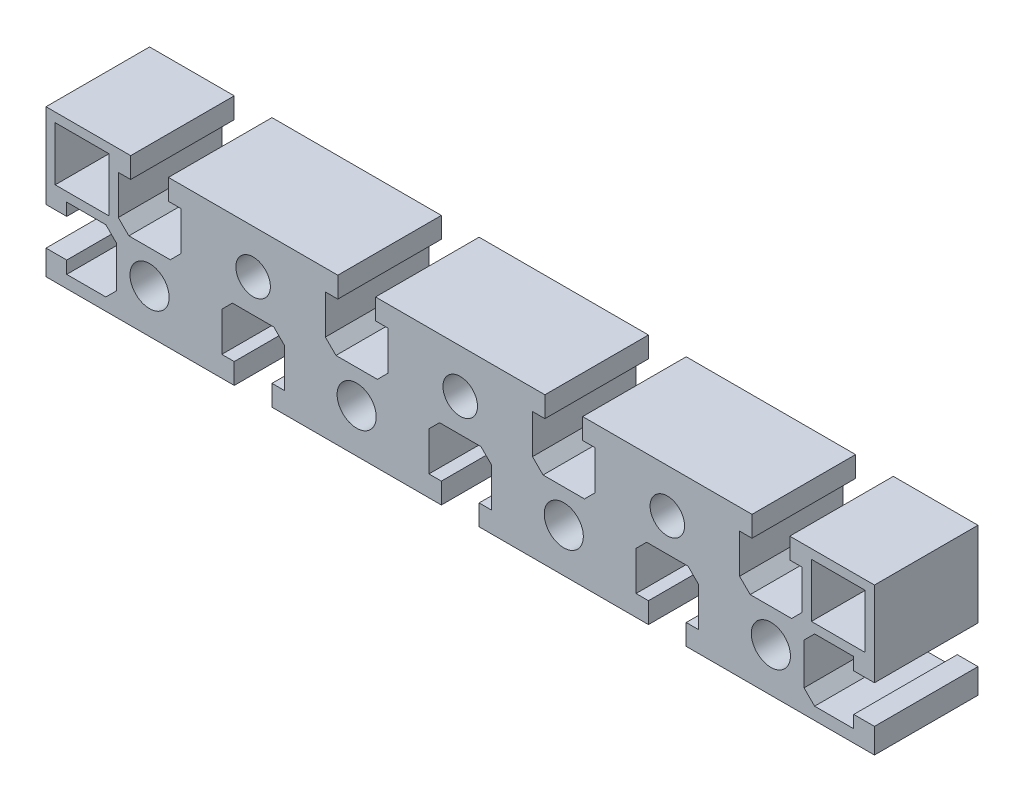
from build123d import *

# Parameters (mm, degrees)
EXTRUDE1_DEPTH             = 11.25
EXTRUDE1_DEPTH_BACK        = 11.25
SKETCH1_R                  = 3.75
SKETCH1_W                  = 11.699951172
SKETCH1_H                  = 11.700012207
F_8_5_8_5_DIAMETER_HOLE1_D = 8.5


with BuildPart() as part:
    # Sketch1 → Extrude1 (new, two sides: drawn at the far end of the back side and taken through both)
    with BuildSketch(Plane.XY.offset(-EXTRUDE1_DEPTH_BACK)):
        Polygon((-74.3, 18), (-71.6, 18), (-71.6, 22.5), (-90, 22.5), (-90, 4.1), (-85.5, 4.1), (-85.5, 6.8), (-77, 6.8), (-74.7, 4.5), (-74.7, -4.5), (-77, -6.8), (-85.5, -6.8), (-85.5, -4.1), (-90, -4.1), (-90, -9.5), (-49.1, -9.5), (-49.1, -5), (-51.8, -5), (-51.8, 3.5), (-49.5, 5.8), (-40.5, 5.8), (-38.2, 3.5), (-38.2, -5), (-40.9, -5), (-40.9, -9.5), (-4.1, -9.5), (-4.1, -5), (-6.8, -5), (-6.8, 3.5), (-4.5, 5.8), (4.5, 5.8), (6.8, 3.5), (6.8, -5), (4.1, -5), (4.1, -9.5), (40.9, -9.5), (40.9, -5), (38.2, -5), (38.2, 3.5), (40.5, 5.8), (49.5, 5.8), (51.8, 3.5), (51.8, -5), (49.1, -5), (49.1, -9.5), (90, -9.5), (90, -4.1), (85.5, -4.1), (85.5, -6.8), (77, -6.8), (74.7, -4.5), (74.7, 4.5), (77, 6.8), (85.5, 6.8), (85.5, 4.1), (90, 4.1), (90, 22.5), (71.6, 22.5), (71.6, 18), (74.3, 18), (74.3, 9.5), (72, 7.2), (63, 7.2), (60.7, 9.5), (60.7, 18), (63.4, 18), (63.4, 22.5), (26.6, 22.5), (26.6, 18), (29.3, 18), (29.3, 9.5), (27, 7.2), (18, 7.2), (15.7, 9.5), (15.7, 18), (18.4, 18), (18.4, 22.5), (-18.4, 22.5), (-18.4, 18), (-15.7, 18), (-15.7, 9.5), (-18, 7.2), (-27, 7.2), (-29.3, 9.5), (-29.3, 18), (-26.6, 18), (-26.6, 22.5), (-63.4, 22.5), (-63.4, 18), (-60.7, 18), (-60.7, 9.5), (-63, 7.2), (-72, 7.2), (-74.3, 9.5), align=None)
        with Locations((67.5, 0)):
            Circle(SKETCH1_R, mode=Mode.SUBTRACT)
        with Locations((45, 13)):
            Circle(SKETCH1_R, mode=Mode.SUBTRACT)
        with Locations((22.5, 0)):
            Circle(SKETCH1_R, mode=Mode.SUBTRACT)
        with Locations((0, 13)):
            Circle(SKETCH1_R, mode=Mode.SUBTRACT)
        with Locations((-22.5, 0)):
            Circle(SKETCH1_R, mode=Mode.SUBTRACT)
        with Locations((-45, 13)):
            Circle(SKETCH1_R, mode=Mode.SUBTRACT)
        with Locations((-67.5, 0)):
            Circle(SKETCH1_R, mode=Mode.SUBTRACT)
        with Locations((82.149975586, 14.649993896)):
            Rectangle(SKETCH1_W, SKETCH1_H, mode=Mode.SUBTRACT)
        with Locations((-82.150024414, 14.649993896)):
            Rectangle(SKETCH1_W, SKETCH1_H, mode=Mode.SUBTRACT)
    extrude(amount=EXTRUDE1_DEPTH + EXTRUDE1_DEPTH_BACK)

    # 8.5 _8.5_ Diameter Hole1 (through all)
    with Locations(Plane(origin=(-67.5, 0, 11.25), x_dir=(1, 0, 0), z_dir=(0, 0, 1))):
        with Locations((0, 0), (45, 0), (90, 0), (135, 0)):
            Hole(F_8_5_8_5_DIAMETER_HOLE1_D / 2)


solid = part.part
